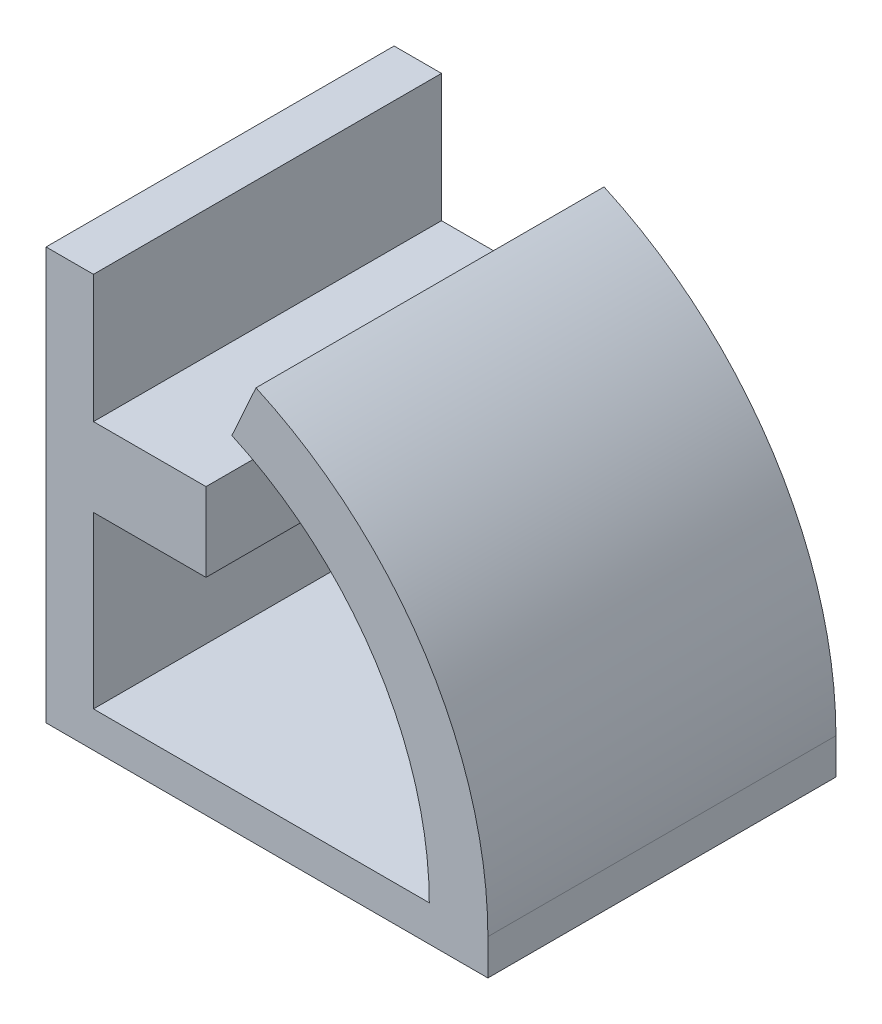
ISO-10303-21;
HEADER;
FILE_DESCRIPTION(('STEP AP214'),'2;1');
FILE_NAME('part.step','',(''),(''),'','','');
FILE_SCHEMA(('AUTOMOTIVE_DESIGN { 1 0 10303 214 1 1 1 1 }'));
ENDSEC;
DATA;
#1=APPLICATION_CONTEXT('core data for automotive mechanical design processes');
#2=APPLICATION_PROTOCOL_DEFINITION('international standard','automotive_design',2000,#1);
#3=PRODUCT_CONTEXT('',#1,'mechanical');
#4=PRODUCT('Part','Part','',(#3));
#5=PRODUCT_RELATED_PRODUCT_CATEGORY('part','',(#4));
#6=PRODUCT_DEFINITION_FORMATION('','',#4);
#7=PRODUCT_DEFINITION_CONTEXT('part definition',#1,'design');
#8=PRODUCT_DEFINITION('design','',#6,#7);
#9=PRODUCT_DEFINITION_SHAPE('','',#8);
#10=(LENGTH_UNIT() NAMED_UNIT(*) SI_UNIT(.MILLI.,.METRE.));
#11=(NAMED_UNIT(*) PLANE_ANGLE_UNIT() SI_UNIT($,.RADIAN.));
#12=(NAMED_UNIT(*) SI_UNIT($,.STERADIAN.) SOLID_ANGLE_UNIT());
#13=UNCERTAINTY_MEASURE_WITH_UNIT(LENGTH_MEASURE(1.E-05),#10,'distance_accuracy_value','');
#14=(GEOMETRIC_REPRESENTATION_CONTEXT(3) GLOBAL_UNCERTAINTY_ASSIGNED_CONTEXT((#13)) GLOBAL_UNIT_ASSIGNED_CONTEXT((#10,
#11,#12)) REPRESENTATION_CONTEXT('',''));
#15=CARTESIAN_POINT('',(0.,0.,0.));
#16=DIRECTION('',(0.,0.,1.));
#17=DIRECTION('',(1.,0.,0.));
#18=AXIS2_PLACEMENT_3D('',#15,#16,#17);
#19=CARTESIAN_POINT('',(18.1175022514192,13.684496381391,66.5));
#20=DIRECTION('',(-1.,0.,0.));
#21=DIRECTION('',(0.,0.,1.));
#22=AXIS2_PLACEMENT_3D('',#19,#20,#21);
#23=PLANE('',#22);
#24=DIRECTION('',(0.,0.,-1.));
#25=VECTOR('',#24,1.);
#26=CARTESIAN_POINT('',(18.1175022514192,78.7188677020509,66.5));
#27=LINE('',#26,#25);
#28=CARTESIAN_POINT('',(18.1175022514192,78.7188677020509,66.5));
#29=VERTEX_POINT('',#28);
#30=CARTESIAN_POINT('',(18.1175022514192,78.7188677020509,-66.5));
#31=VERTEX_POINT('',#30);
#32=EDGE_CURVE('E168',#29,#31,#27,.T.);
#33=ORIENTED_EDGE('',*,*,#32,.F.);
#34=DIRECTION('',(0.,1.,0.));
#35=VECTOR('',#34,1.);
#36=CARTESIAN_POINT('',(18.1175022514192,13.684496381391,66.5));
#37=LINE('',#36,#35);
#38=CARTESIAN_POINT('',(18.1175022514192,13.684496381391,66.5));
#39=VERTEX_POINT('',#38);
#40=EDGE_CURVE('E204',#39,#29,#37,.T.);
#41=ORIENTED_EDGE('',*,*,#40,.F.);
#42=DIRECTION('',(0.,0.,-1.));
#43=VECTOR('',#42,1.);
#44=CARTESIAN_POINT('',(18.1175022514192,13.684496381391,66.5));
#45=LINE('',#44,#43);
#46=CARTESIAN_POINT('',(18.1175022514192,13.684496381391,-66.5));
#47=VERTEX_POINT('',#46);
#48=EDGE_CURVE('E218',#39,#47,#45,.T.);
#49=ORIENTED_EDGE('',*,*,#48,.T.);
#50=DIRECTION('',(0.,1.,0.));
#51=VECTOR('',#50,1.);
#52=CARTESIAN_POINT('',(18.1175022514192,13.684496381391,-66.5));
#53=LINE('',#52,#51);
#54=EDGE_CURVE('E140',#47,#31,#53,.T.);
#55=ORIENTED_EDGE('',*,*,#54,.T.);
#56=EDGE_LOOP('',(#33,#41,#49,#55));
#57=FACE_BOUND('',#56,.T.);
#58=ADVANCED_FACE('F36',(#57),#23,.F.);
#59=DIRECTION('',(0.,0.,1.));
#60=VECTOR('',#59,1.);
#61=CARTESIAN_POINT('',(18.1175022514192,108.761947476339,66.5));
#62=LINE('',#61,#60);
#63=CARTESIAN_POINT('',(18.1175022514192,108.761947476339,-66.5));
#64=VERTEX_POINT('',#63);
#65=CARTESIAN_POINT('',(18.1175022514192,108.761947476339,66.5));
#66=VERTEX_POINT('',#65);
#67=EDGE_CURVE('E173',#64,#66,#62,.T.);
#68=ORIENTED_EDGE('',*,*,#67,.F.);
#69=CARTESIAN_POINT('',(18.1175022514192,157.514311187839,-66.5));
#70=VERTEX_POINT('',#69);
#71=EDGE_CURVE('E142',#64,#70,#53,.T.);
#72=ORIENTED_EDGE('',*,*,#71,.T.);
#73=DIRECTION('',(0.,0.,-1.));
#74=VECTOR('',#73,1.);
#75=CARTESIAN_POINT('',(18.1175022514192,157.514311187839,66.5));
#76=LINE('',#75,#74);
#77=CARTESIAN_POINT('',(18.1175022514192,157.514311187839,66.5));
#78=VERTEX_POINT('',#77);
#79=EDGE_CURVE('E207',#78,#70,#76,.T.);
#80=ORIENTED_EDGE('',*,*,#79,.F.);
#81=EDGE_CURVE('E59',#66,#78,#37,.T.);
#82=ORIENTED_EDGE('',*,*,#81,.F.);
#83=EDGE_LOOP('',(#68,#72,#80,#82));
#84=FACE_BOUND('',#83,.T.);
#85=ADVANCED_FACE('F249',(#84),#23,.F.);
#86=CARTESIAN_POINT('',(18.1175022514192,157.514311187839,66.5));
#87=DIRECTION('',(0.,-1.,0.));
#88=DIRECTION('',(0.,0.,-1.));
#89=AXIS2_PLACEMENT_3D('',#86,#87,#88);
#90=PLANE('',#89);
#91=DIRECTION('',(-1.,0.,0.));
#92=VECTOR('',#91,1.);
#93=CARTESIAN_POINT('',(18.1175022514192,157.514311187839,-66.5));
#94=LINE('',#93,#92);
#95=CARTESIAN_POINT('',(0.,157.514311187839,-66.5));
#96=VERTEX_POINT('',#95);
#97=EDGE_CURVE('E193',#70,#96,#94,.T.);
#98=ORIENTED_EDGE('',*,*,#97,.T.);
#99=DIRECTION('',(0.,0.,-1.));
#100=VECTOR('',#99,1.);
#101=CARTESIAN_POINT('',(0.,157.514311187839,66.5));
#102=LINE('',#101,#100);
#103=CARTESIAN_POINT('',(0.,157.514311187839,66.5));
#104=VERTEX_POINT('',#103);
#105=EDGE_CURVE('E12',#104,#96,#102,.T.);
#106=ORIENTED_EDGE('',*,*,#105,.F.);
#107=DIRECTION('',(-1.,0.,0.));
#108=VECTOR('',#107,1.);
#109=CARTESIAN_POINT('',(18.1175022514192,157.514311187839,66.5));
#110=LINE('',#109,#108);
#111=EDGE_CURVE('E194',#78,#104,#110,.T.);
#112=ORIENTED_EDGE('',*,*,#111,.F.);
#113=ORIENTED_EDGE('',*,*,#79,.T.);
#114=EDGE_LOOP('',(#98,#106,#112,#113));
#115=FACE_BOUND('',#114,.T.);
#116=ADVANCED_FACE('F38',(#115),#90,.F.);
#117=CARTESIAN_POINT('',(0.,157.514311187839,66.5));
#118=DIRECTION('',(1.,0.,0.));
#119=DIRECTION('',(0.,0.,-1.));
#120=AXIS2_PLACEMENT_3D('',#117,#118,#119);
#121=PLANE('',#120);
#122=DIRECTION('',(0.,-1.,0.));
#123=VECTOR('',#122,1.);
#124=CARTESIAN_POINT('',(0.,157.514311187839,-66.5));
#125=LINE('',#124,#123);
#126=CARTESIAN_POINT('',(0.,0.,-66.5));
#127=VERTEX_POINT('',#126);
#128=EDGE_CURVE('E210',#96,#127,#125,.T.);
#129=ORIENTED_EDGE('',*,*,#128,.T.);
#130=DIRECTION('',(0.,0.,-1.));
#131=VECTOR('',#130,1.);
#132=CARTESIAN_POINT('',(0.,0.,66.5));
#133=LINE('',#132,#131);
#134=CARTESIAN_POINT('',(0.,0.,66.5));
#135=VERTEX_POINT('',#134);
#136=EDGE_CURVE('E44',#135,#127,#133,.T.);
#137=ORIENTED_EDGE('',*,*,#136,.F.);
#138=DIRECTION('',(0.,-1.,0.));
#139=VECTOR('',#138,1.);
#140=CARTESIAN_POINT('',(0.,157.514311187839,66.5));
#141=LINE('',#140,#139);
#142=EDGE_CURVE('E197',#104,#135,#141,.T.);
#143=ORIENTED_EDGE('',*,*,#142,.F.);
#144=ORIENTED_EDGE('',*,*,#105,.T.);
#145=EDGE_LOOP('',(#129,#137,#143,#144));
#146=FACE_BOUND('',#145,.T.);
#147=ADVANCED_FACE('F244',(#146),#121,.F.);
#148=CARTESIAN_POINT('',(0.,0.,66.5));
#149=DIRECTION('',(0.,1.,0.));
#150=DIRECTION('',(0.,0.,1.));
#151=AXIS2_PLACEMENT_3D('',#148,#149,#150);
#152=PLANE('',#151);
#153=DIRECTION('',(1.,0.,0.));
#154=VECTOR('',#153,1.);
#155=CARTESIAN_POINT('',(0.,0.,-66.5));
#156=LINE('',#155,#154);
#157=CARTESIAN_POINT('',(168.839701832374,0.,-66.5));
#158=VERTEX_POINT('',#157);
#159=EDGE_CURVE('E212',#127,#158,#156,.T.);
#160=ORIENTED_EDGE('',*,*,#159,.T.);
#161=DIRECTION('',(0.,0.,-1.));
#162=VECTOR('',#161,1.);
#163=CARTESIAN_POINT('',(168.839701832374,0.,66.5));
#164=LINE('',#163,#162);
#165=CARTESIAN_POINT('',(168.839701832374,0.,66.5));
#166=VERTEX_POINT('',#165);
#167=EDGE_CURVE('E223',#166,#158,#164,.T.);
#168=ORIENTED_EDGE('',*,*,#167,.F.);
#169=DIRECTION('',(1.,0.,0.));
#170=VECTOR('',#169,1.);
#171=CARTESIAN_POINT('',(0.,0.,66.5));
#172=LINE('',#171,#170);
#173=EDGE_CURVE('E199',#135,#166,#172,.T.);
#174=ORIENTED_EDGE('',*,*,#173,.F.);
#175=ORIENTED_EDGE('',*,*,#136,.T.);
#176=EDGE_LOOP('',(#160,#168,#174,#175));
#177=FACE_BOUND('',#176,.T.);
#178=ADVANCED_FACE('F230',(#177),#152,.F.);
#179=CARTESIAN_POINT('',(168.839701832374,0.,66.5));
#180=DIRECTION('',(-1.,0.,0.));
#181=DIRECTION('',(0.,0.,1.));
#182=AXIS2_PLACEMENT_3D('',#179,#180,#181);
#183=PLANE('',#182);
#184=DIRECTION('',(0.,1.,0.));
#185=VECTOR('',#184,1.);
#186=CARTESIAN_POINT('',(168.839701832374,0.,-66.5));
#187=LINE('',#186,#185);
#188=CARTESIAN_POINT('',(168.839701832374,13.684496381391,-66.5));
#189=VERTEX_POINT('',#188);
#190=EDGE_CURVE('E143',#158,#189,#187,.T.);
#191=ORIENTED_EDGE('',*,*,#190,.T.);
#192=DIRECTION('',(0.,0.,-1.));
#193=VECTOR('',#192,1.);
#194=CARTESIAN_POINT('',(168.839701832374,13.684496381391,66.5));
#195=LINE('',#194,#193);
#196=CARTESIAN_POINT('',(168.839701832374,13.684496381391,66.5));
#197=VERTEX_POINT('',#196);
#198=EDGE_CURVE('E220',#197,#189,#195,.T.);
#199=ORIENTED_EDGE('',*,*,#198,.F.);
#200=DIRECTION('',(0.,1.,0.));
#201=VECTOR('',#200,1.);
#202=CARTESIAN_POINT('',(168.839701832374,0.,66.5));
#203=LINE('',#202,#201);
#204=EDGE_CURVE('E201',#166,#197,#203,.T.);
#205=ORIENTED_EDGE('',*,*,#204,.F.);
#206=ORIENTED_EDGE('',*,*,#167,.T.);
#207=EDGE_LOOP('',(#191,#199,#205,#206));
#208=FACE_BOUND('',#207,.T.);
#209=ADVANCED_FACE('F236',(#208),#183,.F.);
#210=CARTESIAN_POINT('',(168.839701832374,13.684496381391,66.5));
#211=DIRECTION('',(0.,-1.,0.));
#212=DIRECTION('',(0.,0.,-1.));
#213=AXIS2_PLACEMENT_3D('',#210,#211,#212);
#214=PLANE('',#213);
#215=DIRECTION('',(-1.,0.,0.));
#216=VECTOR('',#215,1.);
#217=CARTESIAN_POINT('',(168.839701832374,13.684496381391,66.5));
#218=LINE('',#217,#216);
#219=CARTESIAN_POINT('',(146.4481546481,13.684496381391,66.5));
#220=VERTEX_POINT('',#219);
#221=EDGE_CURVE('E51',#220,#39,#218,.T.);
#222=ORIENTED_EDGE('',*,*,#221,.F.);
#223=DIRECTION('',(0.,0.,-1.));
#224=VECTOR('',#223,1.);
#225=CARTESIAN_POINT('',(146.4481546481,13.684496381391,0.));
#226=LINE('',#225,#224);
#227=CARTESIAN_POINT('',(146.4481546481,13.684496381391,-66.5));
#228=VERTEX_POINT('',#227);
#229=EDGE_CURVE('E146',#220,#228,#226,.T.);
#230=ORIENTED_EDGE('',*,*,#229,.T.);
#231=DIRECTION('',(-1.,0.,0.));
#232=VECTOR('',#231,1.);
#233=CARTESIAN_POINT('',(168.839701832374,13.684496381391,-66.5));
#234=LINE('',#233,#232);
#235=EDGE_CURVE('E132',#228,#47,#234,.T.);
#236=ORIENTED_EDGE('',*,*,#235,.T.);
#237=ORIENTED_EDGE('',*,*,#48,.F.);
#238=EDGE_LOOP('',(#222,#230,#236,#237));
#239=FACE_BOUND('',#238,.T.);
#240=ADVANCED_FACE('F147',(#239),#214,.F.);
#241=CARTESIAN_POINT('',(0.,157.514311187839,66.5));
#242=DIRECTION('',(0.,0.,1.));
#243=DIRECTION('',(1.,0.,0.));
#244=AXIS2_PLACEMENT_3D('',#241,#242,#243);
#245=PLANE('',#244);
#246=ORIENTED_EDGE('',*,*,#111,.T.);
#247=ORIENTED_EDGE('',*,*,#142,.T.);
#248=ORIENTED_EDGE('',*,*,#173,.T.);
#249=ORIENTED_EDGE('',*,*,#204,.T.);
#250=CARTESIAN_POINT('',(18.1175022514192,13.684496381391,66.5));
#251=DIRECTION('',(0.,0.,-1.));
#252=DIRECTION('',(-1.,0.,0.));
#253=AXIS2_PLACEMENT_3D('',#250,#251,#252);
#254=CIRCLE('',#253,150.722199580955);
#255=CARTESIAN_POINT('',(80.2268873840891,151.01477609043,66.5));
#256=VERTEX_POINT('',#255);
#257=EDGE_CURVE('E158',#256,#197,#254,.T.);
#258=ORIENTED_EDGE('',*,*,#257,.F.);
#259=DIRECTION('',(0.412078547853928,0.911148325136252,0.));
#260=VECTOR('',#259,1.);
#261=CARTESIAN_POINT('',(10.6516682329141,-2.82323545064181,66.5));
#262=LINE('',#261,#260);
#263=CARTESIAN_POINT('',(70.9998111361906,130.612755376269,66.5));
#264=VERTEX_POINT('',#263);
#265=EDGE_CURVE('E262',#264,#256,#262,.T.);
#266=ORIENTED_EDGE('',*,*,#265,.F.);
#267=CARTESIAN_POINT('',(18.1175022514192,13.684496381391,66.5));
#268=DIRECTION('',(0.,0.,-1.));
#269=DIRECTION('',(-1.,0.,0.));
#270=AXIS2_PLACEMENT_3D('',#267,#268,#269);
#271=CIRCLE('',#270,128.330652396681);
#272=EDGE_CURVE('E166',#264,#220,#271,.T.);
#273=ORIENTED_EDGE('',*,*,#272,.T.);
#274=ORIENTED_EDGE('',*,*,#221,.T.);
#275=ORIENTED_EDGE('',*,*,#40,.T.);
#276=DIRECTION('',(-1.,0.,0.));
#277=VECTOR('',#276,1.);
#278=CARTESIAN_POINT('',(61.1175022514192,78.7188677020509,66.5));
#279=LINE('',#278,#277);
#280=CARTESIAN_POINT('',(61.1175022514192,78.7188677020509,66.5));
#281=VERTEX_POINT('',#280);
#282=EDGE_CURVE('E190',#281,#29,#279,.T.);
#283=ORIENTED_EDGE('',*,*,#282,.F.);
#284=DIRECTION('',(0.,-1.,0.));
#285=VECTOR('',#284,1.);
#286=CARTESIAN_POINT('',(61.1175022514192,108.761947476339,66.5));
#287=LINE('',#286,#285);
#288=CARTESIAN_POINT('',(61.1175022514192,108.761947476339,66.5));
#289=VERTEX_POINT('',#288);
#290=EDGE_CURVE('E169',#289,#281,#287,.T.);
#291=ORIENTED_EDGE('',*,*,#290,.F.);
#292=DIRECTION('',(-1.,0.,0.));
#293=VECTOR('',#292,1.);
#294=CARTESIAN_POINT('',(61.1175022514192,108.761947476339,66.5));
#295=LINE('',#294,#293);
#296=EDGE_CURVE('E179',#289,#66,#295,.T.);
#297=ORIENTED_EDGE('',*,*,#296,.T.);
#298=ORIENTED_EDGE('',*,*,#81,.T.);
#299=EDGE_LOOP('',(#246,#247,#248,#249,#258,#266,#273,#274,#275,#283,#291,#297,#298));
#300=FACE_BOUND('',#299,.T.);
#301=ADVANCED_FACE('F239',(#300),#245,.T.);
#302=CARTESIAN_POINT('',(0.,157.514311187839,-66.5));
#303=DIRECTION('',(0.,0.,1.));
#304=DIRECTION('',(1.,0.,0.));
#305=AXIS2_PLACEMENT_3D('',#302,#303,#304);
#306=PLANE('',#305);
#307=ORIENTED_EDGE('',*,*,#97,.F.);
#308=ORIENTED_EDGE('',*,*,#71,.F.);
#309=DIRECTION('',(-1.,0.,0.));
#310=VECTOR('',#309,1.);
#311=CARTESIAN_POINT('',(61.1175022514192,108.761947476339,-66.5));
#312=LINE('',#311,#310);
#313=CARTESIAN_POINT('',(61.1175022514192,108.761947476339,-66.5));
#314=VERTEX_POINT('',#313);
#315=EDGE_CURVE('E185',#314,#64,#312,.T.);
#316=ORIENTED_EDGE('',*,*,#315,.F.);
#317=DIRECTION('',(0.,1.,0.));
#318=VECTOR('',#317,1.);
#319=CARTESIAN_POINT('',(61.1175022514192,108.761947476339,-66.5));
#320=LINE('',#319,#318);
#321=CARTESIAN_POINT('',(61.1175022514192,78.7188677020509,-66.5));
#322=VERTEX_POINT('',#321);
#323=EDGE_CURVE('E175',#322,#314,#320,.T.);
#324=ORIENTED_EDGE('',*,*,#323,.F.);
#325=DIRECTION('',(-1.,0.,0.));
#326=VECTOR('',#325,1.);
#327=CARTESIAN_POINT('',(61.1175022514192,78.7188677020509,-66.5));
#328=LINE('',#327,#326);
#329=EDGE_CURVE('E188',#322,#31,#328,.T.);
#330=ORIENTED_EDGE('',*,*,#329,.T.);
#331=ORIENTED_EDGE('',*,*,#54,.F.);
#332=ORIENTED_EDGE('',*,*,#235,.F.);
#333=CARTESIAN_POINT('',(18.1175022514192,13.684496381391,-66.5));
#334=DIRECTION('',(0.,0.,-1.));
#335=DIRECTION('',(-1.,0.,0.));
#336=AXIS2_PLACEMENT_3D('',#333,#334,#335);
#337=CIRCLE('',#336,128.330652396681);
#338=CARTESIAN_POINT('',(70.9998111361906,130.612755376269,-66.5));
#339=VERTEX_POINT('',#338);
#340=EDGE_CURVE('E137',#339,#228,#337,.T.);
#341=ORIENTED_EDGE('',*,*,#340,.F.);
#342=DIRECTION('',(-0.412078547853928,-0.911148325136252,0.));
#343=VECTOR('',#342,1.);
#344=CARTESIAN_POINT('',(10.6516682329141,-2.82323545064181,-66.5));
#345=LINE('',#344,#343);
#346=CARTESIAN_POINT('',(80.2268873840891,151.01477609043,-66.5));
#347=VERTEX_POINT('',#346);
#348=EDGE_CURVE('E155',#347,#339,#345,.T.);
#349=ORIENTED_EDGE('',*,*,#348,.F.);
#350=CARTESIAN_POINT('',(18.1175022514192,13.684496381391,-66.5));
#351=DIRECTION('',(0.,0.,-1.));
#352=DIRECTION('',(-1.,0.,0.));
#353=AXIS2_PLACEMENT_3D('',#350,#351,#352);
#354=CIRCLE('',#353,150.722199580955);
#355=EDGE_CURVE('E154',#347,#189,#354,.T.);
#356=ORIENTED_EDGE('',*,*,#355,.T.);
#357=ORIENTED_EDGE('',*,*,#190,.F.);
#358=ORIENTED_EDGE('',*,*,#159,.F.);
#359=ORIENTED_EDGE('',*,*,#128,.F.);
#360=EDGE_LOOP('',(#307,#308,#316,#324,#330,#331,#332,#341,#349,#356,#357,#358,#359));
#361=FACE_BOUND('',#360,.T.);
#362=ADVANCED_FACE('F134',(#361),#306,.F.);
#363=CARTESIAN_POINT('',(61.1175022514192,78.7188677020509,66.5));
#364=DIRECTION('',(0.,1.,0.));
#365=DIRECTION('',(0.,0.,1.));
#366=AXIS2_PLACEMENT_3D('',#363,#364,#365);
#367=PLANE('',#366);
#368=ORIENTED_EDGE('',*,*,#32,.T.);
#369=ORIENTED_EDGE('',*,*,#329,.F.);
#370=DIRECTION('',(0.,0.,-1.));
#371=VECTOR('',#370,1.);
#372=CARTESIAN_POINT('',(61.1175022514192,78.7188677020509,66.5));
#373=LINE('',#372,#371);
#374=EDGE_CURVE('E172',#281,#322,#373,.T.);
#375=ORIENTED_EDGE('',*,*,#374,.F.);
#376=ORIENTED_EDGE('',*,*,#282,.T.);
#377=EDGE_LOOP('',(#368,#369,#375,#376));
#378=FACE_BOUND('',#377,.T.);
#379=ADVANCED_FACE('F259',(#378),#367,.F.);
#380=CARTESIAN_POINT('',(61.1175022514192,108.761947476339,66.5));
#381=DIRECTION('',(0.,-1.,0.));
#382=DIRECTION('',(0.,0.,-1.));
#383=AXIS2_PLACEMENT_3D('',#380,#381,#382);
#384=PLANE('',#383);
#385=ORIENTED_EDGE('',*,*,#67,.T.);
#386=ORIENTED_EDGE('',*,*,#296,.F.);
#387=DIRECTION('',(0.,0.,1.));
#388=VECTOR('',#387,1.);
#389=CARTESIAN_POINT('',(61.1175022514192,108.761947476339,66.5));
#390=LINE('',#389,#388);
#391=EDGE_CURVE('E177',#314,#289,#390,.T.);
#392=ORIENTED_EDGE('',*,*,#391,.F.);
#393=ORIENTED_EDGE('',*,*,#315,.T.);
#394=EDGE_LOOP('',(#385,#386,#392,#393));
#395=FACE_BOUND('',#394,.T.);
#396=ADVANCED_FACE('F252',(#395),#384,.F.);
#397=CARTESIAN_POINT('',(61.1175022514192,78.7188677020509,66.5));
#398=DIRECTION('',(1.,0.,0.));
#399=DIRECTION('',(0.,0.,-1.));
#400=AXIS2_PLACEMENT_3D('',#397,#398,#399);
#401=PLANE('',#400);
#402=ORIENTED_EDGE('',*,*,#290,.T.);
#403=ORIENTED_EDGE('',*,*,#374,.T.);
#404=ORIENTED_EDGE('',*,*,#323,.T.);
#405=ORIENTED_EDGE('',*,*,#391,.T.);
#406=EDGE_LOOP('',(#402,#403,#404,#405));
#407=FACE_BOUND('',#406,.T.);
#408=ADVANCED_FACE('F255',(#407),#401,.T.);
#409=CARTESIAN_POINT('',(18.1175022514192,13.684496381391,66.5));
#410=DIRECTION('',(0.,0.,-1.));
#411=DIRECTION('',(-1.,0.,0.));
#412=AXIS2_PLACEMENT_3D('',#409,#410,#411);
#413=CYLINDRICAL_SURFACE('',#412,128.330652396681);
#414=ORIENTED_EDGE('',*,*,#272,.F.);
#415=DIRECTION('',(0.,0.,-1.));
#416=VECTOR('',#415,1.);
#417=CARTESIAN_POINT('',(70.9998111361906,130.612755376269,0.));
#418=LINE('',#417,#416);
#419=EDGE_CURVE('E149',#264,#339,#418,.T.);
#420=ORIENTED_EDGE('',*,*,#419,.T.);
#421=ORIENTED_EDGE('',*,*,#340,.T.);
#422=ORIENTED_EDGE('',*,*,#229,.F.);
#423=EDGE_LOOP('',(#414,#420,#421,#422));
#424=FACE_BOUND('',#423,.T.);
#425=ADVANCED_FACE('F151',(#424),#413,.F.);
#426=CARTESIAN_POINT('',(18.1175022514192,13.684496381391,66.5));
#427=DIRECTION('',(0.,0.,-1.));
#428=DIRECTION('',(-1.,0.,0.));
#429=AXIS2_PLACEMENT_3D('',#426,#427,#428);
#430=CYLINDRICAL_SURFACE('',#429,150.722199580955);
#431=ORIENTED_EDGE('',*,*,#355,.F.);
#432=DIRECTION('',(0.,0.,-1.));
#433=VECTOR('',#432,1.);
#434=CARTESIAN_POINT('',(80.2268873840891,151.01477609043,0.));
#435=LINE('',#434,#433);
#436=EDGE_CURVE('E160',#256,#347,#435,.T.);
#437=ORIENTED_EDGE('',*,*,#436,.F.);
#438=ORIENTED_EDGE('',*,*,#257,.T.);
#439=ORIENTED_EDGE('',*,*,#198,.T.);
#440=EDGE_LOOP('',(#431,#437,#438,#439));
#441=FACE_BOUND('',#440,.T.);
#442=ADVANCED_FACE('F270',(#441),#430,.T.);
#443=CARTESIAN_POINT('',(10.6516682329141,-2.82323545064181,0.));
#444=DIRECTION('',(-0.911148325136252,0.412078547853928,0.));
#445=DIRECTION('',(0.,0.,1.));
#446=AXIS2_PLACEMENT_3D('',#443,#444,#445);
#447=PLANE('',#446);
#448=ORIENTED_EDGE('',*,*,#419,.F.);
#449=ORIENTED_EDGE('',*,*,#265,.T.);
#450=ORIENTED_EDGE('',*,*,#436,.T.);
#451=ORIENTED_EDGE('',*,*,#348,.T.);
#452=EDGE_LOOP('',(#448,#449,#450,#451));
#453=FACE_BOUND('',#452,.T.);
#454=ADVANCED_FACE('F264',(#453),#447,.T.);
#455=CLOSED_SHELL('',(#58,#85,#116,#147,#178,#209,#240,#301,#362,#379,#396,#408,#425,#442,#454));
#456=MANIFOLD_SOLID_BREP('B2',#455);
#457=ADVANCED_BREP_SHAPE_REPRESENTATION('',(#18,#456),#14);
#458=SHAPE_DEFINITION_REPRESENTATION(#9,#457);
ENDSEC;
END-ISO-10303-21;
